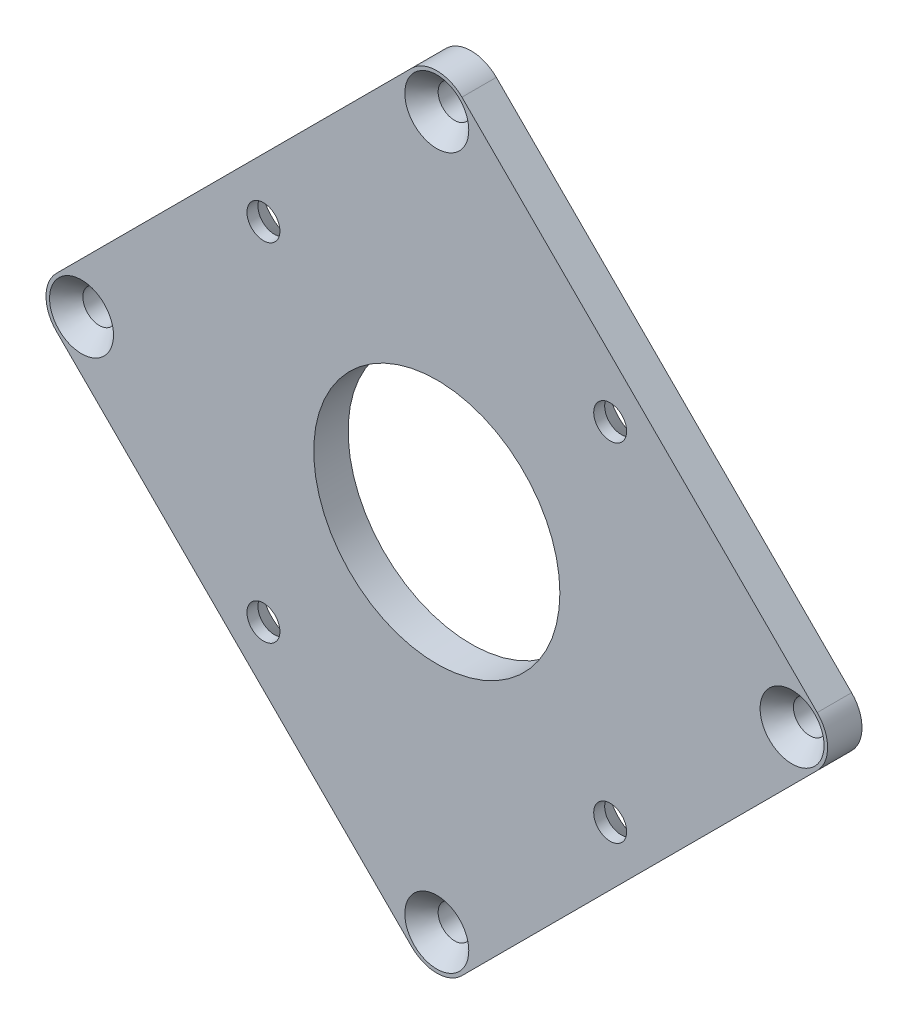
ISO-10303-21;
HEADER;
FILE_DESCRIPTION(('STEP AP214'),'2;1');
FILE_NAME('part.step','',(''),(''),'','','');
FILE_SCHEMA(('AUTOMOTIVE_DESIGN { 1 0 10303 214 1 1 1 1 }'));
ENDSEC;
DATA;
#1=APPLICATION_CONTEXT('core data for automotive mechanical design processes');
#2=APPLICATION_PROTOCOL_DEFINITION('international standard','automotive_design',2000,#1);
#3=PRODUCT_CONTEXT('',#1,'mechanical');
#4=PRODUCT('Part','Part','',(#3));
#5=PRODUCT_RELATED_PRODUCT_CATEGORY('part','',(#4));
#6=PRODUCT_DEFINITION_FORMATION('','',#4);
#7=PRODUCT_DEFINITION_CONTEXT('part definition',#1,'design');
#8=PRODUCT_DEFINITION('design','',#6,#7);
#9=PRODUCT_DEFINITION_SHAPE('','',#8);
#10=(LENGTH_UNIT() NAMED_UNIT(*) SI_UNIT(.MILLI.,.METRE.));
#11=(NAMED_UNIT(*) PLANE_ANGLE_UNIT() SI_UNIT($,.RADIAN.));
#12=(NAMED_UNIT(*) SI_UNIT($,.STERADIAN.) SOLID_ANGLE_UNIT());
#13=UNCERTAINTY_MEASURE_WITH_UNIT(LENGTH_MEASURE(1.E-05),#10,'distance_accuracy_value','');
#14=(GEOMETRIC_REPRESENTATION_CONTEXT(3) GLOBAL_UNCERTAINTY_ASSIGNED_CONTEXT((#13)) GLOBAL_UNIT_ASSIGNED_CONTEXT((#10,
#11,#12)) REPRESENTATION_CONTEXT('',''));
#15=CARTESIAN_POINT('',(0.,0.,0.));
#16=DIRECTION('',(0.,0.,1.));
#17=DIRECTION('',(1.,0.,0.));
#18=AXIS2_PLACEMENT_3D('',#15,#16,#17);
#19=CARTESIAN_POINT('',(-31.75,0.,3.0734));
#20=DIRECTION('',(0.,0.,1.));
#21=DIRECTION('',(1.,0.,0.));
#22=AXIS2_PLACEMENT_3D('',#19,#20,#21);
#23=PLANE('',#22);
#24=CARTESIAN_POINT('',(0.,-31.75,3.0734));
#25=DIRECTION('',(0.,0.,1.));
#26=DIRECTION('',(1.,0.,0.));
#27=AXIS2_PLACEMENT_3D('',#24,#25,#26);
#28=CIRCLE('',#27,2.857501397);
#29=CARTESIAN_POINT('',(2.857501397,-31.75,3.0734));
#30=VERTEX_POINT('',#29);
#31=EDGE_CURVE('E307',#30,#30,#28,.T.);
#32=ORIENTED_EDGE('',*,*,#31,.F.);
#33=EDGE_LOOP('',(#32));
#34=FACE_BOUND('',#33,.T.);
#35=CARTESIAN_POINT('',(-31.75,0.,3.0734));
#36=DIRECTION('',(0.,0.,1.));
#37=DIRECTION('',(1.,0.,0.));
#38=AXIS2_PLACEMENT_3D('',#35,#36,#37);
#39=CIRCLE('',#38,2.857501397);
#40=CARTESIAN_POINT('',(-28.892498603,0.,3.0734));
#41=VERTEX_POINT('',#40);
#42=EDGE_CURVE('E295',#41,#41,#39,.T.);
#43=ORIENTED_EDGE('',*,*,#42,.F.);
#44=EDGE_LOOP('',(#43));
#45=FACE_BOUND('',#44,.T.);
#46=CARTESIAN_POINT('',(0.,31.75,3.0734));
#47=DIRECTION('',(0.,0.,1.));
#48=DIRECTION('',(1.,0.,0.));
#49=AXIS2_PLACEMENT_3D('',#46,#47,#48);
#50=CIRCLE('',#49,2.857501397);
#51=CARTESIAN_POINT('',(2.857501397,31.75,3.0734));
#52=VERTEX_POINT('',#51);
#53=EDGE_CURVE('E283',#52,#52,#50,.T.);
#54=ORIENTED_EDGE('',*,*,#53,.F.);
#55=EDGE_LOOP('',(#54));
#56=FACE_BOUND('',#55,.T.);
#57=CARTESIAN_POINT('',(31.75,0.,3.0734));
#58=DIRECTION('',(0.,0.,1.));
#59=DIRECTION('',(1.,0.,0.));
#60=AXIS2_PLACEMENT_3D('',#57,#58,#59);
#61=CIRCLE('',#60,2.857501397);
#62=CARTESIAN_POINT('',(34.607501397,0.,3.0734));
#63=VERTEX_POINT('',#62);
#64=EDGE_CURVE('E271',#63,#63,#61,.T.);
#65=ORIENTED_EDGE('',*,*,#64,.F.);
#66=EDGE_LOOP('',(#65));
#67=FACE_BOUND('',#66,.T.);
#68=CARTESIAN_POINT('',(-15.494,-15.494,3.0734));
#69=DIRECTION('',(0.,0.,-1.));
#70=DIRECTION('',(-1.,0.,0.));
#71=AXIS2_PLACEMENT_3D('',#68,#69,#70);
#72=CIRCLE('',#71,1.4732);
#73=CARTESIAN_POINT('',(-16.9672,-15.494,3.0734));
#74=VERTEX_POINT('',#73);
#75=EDGE_CURVE('E251',#74,#74,#72,.T.);
#76=ORIENTED_EDGE('',*,*,#75,.T.);
#77=EDGE_LOOP('',(#76));
#78=FACE_BOUND('',#77,.T.);
#79=CARTESIAN_POINT('',(15.494,-15.494,3.0734));
#80=DIRECTION('',(0.,0.,-1.));
#81=DIRECTION('',(-1.,0.,0.));
#82=AXIS2_PLACEMENT_3D('',#79,#80,#81);
#83=CIRCLE('',#82,1.4732);
#84=CARTESIAN_POINT('',(14.0208,-15.494,3.0734));
#85=VERTEX_POINT('',#84);
#86=EDGE_CURVE('E239',#85,#85,#83,.T.);
#87=ORIENTED_EDGE('',*,*,#86,.T.);
#88=EDGE_LOOP('',(#87));
#89=FACE_BOUND('',#88,.T.);
#90=CARTESIAN_POINT('',(15.494,15.494,3.0734));
#91=DIRECTION('',(0.,0.,-1.));
#92=DIRECTION('',(-1.,0.,0.));
#93=AXIS2_PLACEMENT_3D('',#90,#91,#92);
#94=CIRCLE('',#93,1.4732);
#95=CARTESIAN_POINT('',(14.0208,15.494,3.0734));
#96=VERTEX_POINT('',#95);
#97=EDGE_CURVE('E227',#96,#96,#94,.T.);
#98=ORIENTED_EDGE('',*,*,#97,.T.);
#99=EDGE_LOOP('',(#98));
#100=FACE_BOUND('',#99,.T.);
#101=CARTESIAN_POINT('',(-15.494,15.494,3.0734));
#102=DIRECTION('',(0.,0.,-1.));
#103=DIRECTION('',(-1.,0.,0.));
#104=AXIS2_PLACEMENT_3D('',#101,#102,#103);
#105=CIRCLE('',#104,1.4732);
#106=CARTESIAN_POINT('',(-16.9672,15.494,3.0734));
#107=VERTEX_POINT('',#106);
#108=EDGE_CURVE('E212',#107,#107,#105,.T.);
#109=ORIENTED_EDGE('',*,*,#108,.T.);
#110=EDGE_LOOP('',(#109));
#111=FACE_BOUND('',#110,.T.);
#112=CARTESIAN_POINT('',(-31.75,0.,3.0734));
#113=DIRECTION('',(0.,0.,1.));
#114=DIRECTION('',(1.,0.,0.));
#115=AXIS2_PLACEMENT_3D('',#112,#113,#114);
#116=CIRCLE('',#115,3.175);
#117=CARTESIAN_POINT('',(-33.9950640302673,2.24506403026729,3.0734));
#118=VERTEX_POINT('',#117);
#119=CARTESIAN_POINT('',(-33.9950640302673,-2.24506403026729,3.0734));
#120=VERTEX_POINT('',#119);
#121=EDGE_CURVE('E163',#118,#120,#116,.T.);
#122=ORIENTED_EDGE('',*,*,#121,.T.);
#123=DIRECTION('',(0.707106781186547,-0.707106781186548,0.));
#124=VECTOR('',#123,1.);
#125=CARTESIAN_POINT('',(-33.9950640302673,-2.24506403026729,3.0734));
#126=LINE('',#125,#124);
#127=CARTESIAN_POINT('',(-2.24506403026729,-33.9950640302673,3.0734));
#128=VERTEX_POINT('',#127);
#129=EDGE_CURVE('E99',#120,#128,#126,.T.);
#130=ORIENTED_EDGE('',*,*,#129,.T.);
#131=CARTESIAN_POINT('',(0.,-31.75,3.0734));
#132=DIRECTION('',(0.,0.,1.));
#133=DIRECTION('',(1.,0.,0.));
#134=AXIS2_PLACEMENT_3D('',#131,#132,#133);
#135=CIRCLE('',#134,3.175);
#136=CARTESIAN_POINT('',(2.24506403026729,-33.9950640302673,3.0734));
#137=VERTEX_POINT('',#136);
#138=EDGE_CURVE('E184',#128,#137,#135,.T.);
#139=ORIENTED_EDGE('',*,*,#138,.T.);
#140=DIRECTION('',(0.707106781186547,0.707106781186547,0.));
#141=VECTOR('',#140,1.);
#142=CARTESIAN_POINT('',(2.24506403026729,-33.9950640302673,3.0734));
#143=LINE('',#142,#141);
#144=CARTESIAN_POINT('',(33.9950640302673,-2.24506403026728,3.0734));
#145=VERTEX_POINT('',#144);
#146=EDGE_CURVE('E198',#137,#145,#143,.T.);
#147=ORIENTED_EDGE('',*,*,#146,.T.);
#148=CARTESIAN_POINT('',(31.75,0.,3.0734));
#149=DIRECTION('',(0.,0.,1.));
#150=DIRECTION('',(1.,0.,0.));
#151=AXIS2_PLACEMENT_3D('',#148,#149,#150);
#152=CIRCLE('',#151,3.17499999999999);
#153=CARTESIAN_POINT('',(33.9950640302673,2.24506403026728,3.0734));
#154=VERTEX_POINT('',#153);
#155=EDGE_CURVE('E118',#145,#154,#152,.T.);
#156=ORIENTED_EDGE('',*,*,#155,.T.);
#157=DIRECTION('',(-0.707106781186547,0.707106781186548,0.));
#158=VECTOR('',#157,1.);
#159=CARTESIAN_POINT('',(33.9950640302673,2.24506403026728,3.0734));
#160=LINE('',#159,#158);
#161=CARTESIAN_POINT('',(2.24506403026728,33.9950640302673,3.0734));
#162=VERTEX_POINT('',#161);
#163=EDGE_CURVE('E112',#154,#162,#160,.T.);
#164=ORIENTED_EDGE('',*,*,#163,.T.);
#165=CARTESIAN_POINT('',(0.,31.75,3.0734));
#166=DIRECTION('',(0.,0.,1.));
#167=DIRECTION('',(-1.,0.,0.));
#168=AXIS2_PLACEMENT_3D('',#165,#166,#167);
#169=CIRCLE('',#168,3.17499999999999);
#170=CARTESIAN_POINT('',(-2.24506403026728,33.9950640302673,3.0734));
#171=VERTEX_POINT('',#170);
#172=EDGE_CURVE('E116',#162,#171,#169,.T.);
#173=ORIENTED_EDGE('',*,*,#172,.T.);
#174=DIRECTION('',(-0.707106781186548,-0.707106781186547,0.));
#175=VECTOR('',#174,1.);
#176=CARTESIAN_POINT('',(-2.24506403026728,33.9950640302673,3.0734));
#177=LINE('',#176,#175);
#178=EDGE_CURVE('E56',#171,#118,#177,.T.);
#179=ORIENTED_EDGE('',*,*,#178,.T.);
#180=EDGE_LOOP('',(#122,#130,#139,#147,#156,#164,#173,#179));
#181=FACE_BOUND('',#180,.T.);
#182=CARTESIAN_POINT('',(0.,0.,3.0734));
#183=DIRECTION('',(0.,0.,1.));
#184=DIRECTION('',(1.,0.,0.));
#185=AXIS2_PLACEMENT_3D('',#182,#183,#184);
#186=CIRCLE('',#185,10.9982);
#187=CARTESIAN_POINT('',(10.9982,0.,3.0734));
#188=VERTEX_POINT('',#187);
#189=EDGE_CURVE('E145',#188,#188,#186,.T.);
#190=ORIENTED_EDGE('',*,*,#189,.F.);
#191=EDGE_LOOP('',(#190));
#192=FACE_BOUND('',#191,.T.);
#193=ADVANCED_FACE('F38',(#34,#45,#56,#67,#78,#89,#100,#111,#181,#192),#23,.T.);
#194=CARTESIAN_POINT('',(-31.75,0.,0.));
#195=DIRECTION('',(0.,0.,1.));
#196=DIRECTION('',(1.,0.,0.));
#197=AXIS2_PLACEMENT_3D('',#194,#195,#196);
#198=PLANE('',#197);
#199=CARTESIAN_POINT('',(0.,-31.75,0.));
#200=DIRECTION('',(0.,0.,1.));
#201=DIRECTION('',(1.,0.,0.));
#202=AXIS2_PLACEMENT_3D('',#199,#200,#201);
#203=CIRCLE('',#202,1.4732);
#204=CARTESIAN_POINT('',(1.4732,-31.75,0.));
#205=VERTEX_POINT('',#204);
#206=EDGE_CURVE('E299',#205,#205,#203,.T.);
#207=ORIENTED_EDGE('',*,*,#206,.T.);
#208=EDGE_LOOP('',(#207));
#209=FACE_BOUND('',#208,.T.);
#210=CARTESIAN_POINT('',(-31.75,0.,0.));
#211=DIRECTION('',(0.,0.,1.));
#212=DIRECTION('',(1.,0.,0.));
#213=AXIS2_PLACEMENT_3D('',#210,#211,#212);
#214=CIRCLE('',#213,1.4732);
#215=CARTESIAN_POINT('',(-30.2768,0.,0.));
#216=VERTEX_POINT('',#215);
#217=EDGE_CURVE('E287',#216,#216,#214,.T.);
#218=ORIENTED_EDGE('',*,*,#217,.T.);
#219=EDGE_LOOP('',(#218));
#220=FACE_BOUND('',#219,.T.);
#221=CARTESIAN_POINT('',(0.,31.75,0.));
#222=DIRECTION('',(0.,0.,1.));
#223=DIRECTION('',(1.,0.,0.));
#224=AXIS2_PLACEMENT_3D('',#221,#222,#223);
#225=CIRCLE('',#224,1.4732);
#226=CARTESIAN_POINT('',(1.4732,31.75,0.));
#227=VERTEX_POINT('',#226);
#228=EDGE_CURVE('E275',#227,#227,#225,.T.);
#229=ORIENTED_EDGE('',*,*,#228,.T.);
#230=EDGE_LOOP('',(#229));
#231=FACE_BOUND('',#230,.T.);
#232=CARTESIAN_POINT('',(31.75,0.,0.));
#233=DIRECTION('',(0.,0.,1.));
#234=DIRECTION('',(1.,0.,0.));
#235=AXIS2_PLACEMENT_3D('',#232,#233,#234);
#236=CIRCLE('',#235,1.4732);
#237=CARTESIAN_POINT('',(33.2232,0.,0.));
#238=VERTEX_POINT('',#237);
#239=EDGE_CURVE('E263',#238,#238,#236,.T.);
#240=ORIENTED_EDGE('',*,*,#239,.T.);
#241=EDGE_LOOP('',(#240));
#242=FACE_BOUND('',#241,.T.);
#243=CARTESIAN_POINT('',(-15.494,-15.494,0.));
#244=DIRECTION('',(0.,0.,-1.));
#245=DIRECTION('',(-1.,0.,0.));
#246=AXIS2_PLACEMENT_3D('',#243,#244,#245);
#247=CIRCLE('',#246,3.2921448);
#248=CARTESIAN_POINT('',(-18.7861448,-15.494,0.));
#249=VERTEX_POINT('',#248);
#250=EDGE_CURVE('E259',#249,#249,#247,.T.);
#251=ORIENTED_EDGE('',*,*,#250,.F.);
#252=EDGE_LOOP('',(#251));
#253=FACE_BOUND('',#252,.T.);
#254=CARTESIAN_POINT('',(15.494,-15.494,0.));
#255=DIRECTION('',(0.,0.,-1.));
#256=DIRECTION('',(-1.,0.,0.));
#257=AXIS2_PLACEMENT_3D('',#254,#255,#256);
#258=CIRCLE('',#257,3.2921448);
#259=CARTESIAN_POINT('',(12.2018552,-15.494,0.));
#260=VERTEX_POINT('',#259);
#261=EDGE_CURVE('E247',#260,#260,#258,.T.);
#262=ORIENTED_EDGE('',*,*,#261,.F.);
#263=EDGE_LOOP('',(#262));
#264=FACE_BOUND('',#263,.T.);
#265=CARTESIAN_POINT('',(15.494,15.494,0.));
#266=DIRECTION('',(0.,0.,-1.));
#267=DIRECTION('',(-1.,0.,0.));
#268=AXIS2_PLACEMENT_3D('',#265,#266,#267);
#269=CIRCLE('',#268,3.2921448);
#270=CARTESIAN_POINT('',(12.2018552,15.494,0.));
#271=VERTEX_POINT('',#270);
#272=EDGE_CURVE('E235',#271,#271,#269,.T.);
#273=ORIENTED_EDGE('',*,*,#272,.F.);
#274=EDGE_LOOP('',(#273));
#275=FACE_BOUND('',#274,.T.);
#276=CARTESIAN_POINT('',(-15.494,15.494,0.));
#277=DIRECTION('',(0.,0.,-1.));
#278=DIRECTION('',(-1.,0.,0.));
#279=AXIS2_PLACEMENT_3D('',#276,#277,#278);
#280=CIRCLE('',#279,3.2921448);
#281=CARTESIAN_POINT('',(-18.7861448,15.494,0.));
#282=VERTEX_POINT('',#281);
#283=EDGE_CURVE('E223',#282,#282,#280,.T.);
#284=ORIENTED_EDGE('',*,*,#283,.F.);
#285=EDGE_LOOP('',(#284));
#286=FACE_BOUND('',#285,.T.);
#287=CARTESIAN_POINT('',(-31.75,0.,0.));
#288=DIRECTION('',(0.,0.,1.));
#289=DIRECTION('',(1.,0.,0.));
#290=AXIS2_PLACEMENT_3D('',#287,#288,#289);
#291=CIRCLE('',#290,3.175);
#292=CARTESIAN_POINT('',(-33.9950640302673,2.24506403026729,0.));
#293=VERTEX_POINT('',#292);
#294=CARTESIAN_POINT('',(-33.9950640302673,-2.24506403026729,0.));
#295=VERTEX_POINT('',#294);
#296=EDGE_CURVE('E140',#293,#295,#291,.T.);
#297=ORIENTED_EDGE('',*,*,#296,.F.);
#298=DIRECTION('',(-0.707106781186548,-0.707106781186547,0.));
#299=VECTOR('',#298,1.);
#300=CARTESIAN_POINT('',(-2.24506403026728,33.9950640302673,0.));
#301=LINE('',#300,#299);
#302=CARTESIAN_POINT('',(-2.24506403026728,33.9950640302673,0.));
#303=VERTEX_POINT('',#302);
#304=EDGE_CURVE('E91',#303,#293,#301,.T.);
#305=ORIENTED_EDGE('',*,*,#304,.F.);
#306=CARTESIAN_POINT('',(0.,31.75,0.));
#307=DIRECTION('',(0.,0.,1.));
#308=DIRECTION('',(-1.,0.,0.));
#309=AXIS2_PLACEMENT_3D('',#306,#307,#308);
#310=CIRCLE('',#309,3.17499999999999);
#311=CARTESIAN_POINT('',(2.24506403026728,33.9950640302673,0.));
#312=VERTEX_POINT('',#311);
#313=EDGE_CURVE('E85',#312,#303,#310,.T.);
#314=ORIENTED_EDGE('',*,*,#313,.F.);
#315=DIRECTION('',(-0.707106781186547,0.707106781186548,0.));
#316=VECTOR('',#315,1.);
#317=CARTESIAN_POINT('',(33.9950640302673,2.24506403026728,0.));
#318=LINE('',#317,#316);
#319=CARTESIAN_POINT('',(33.9950640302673,2.24506403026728,0.));
#320=VERTEX_POINT('',#319);
#321=EDGE_CURVE('E127',#320,#312,#318,.T.);
#322=ORIENTED_EDGE('',*,*,#321,.F.);
#323=CARTESIAN_POINT('',(31.75,0.,0.));
#324=DIRECTION('',(0.,0.,1.));
#325=DIRECTION('',(1.,0.,0.));
#326=AXIS2_PLACEMENT_3D('',#323,#324,#325);
#327=CIRCLE('',#326,3.17499999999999);
#328=CARTESIAN_POINT('',(33.9950640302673,-2.24506403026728,0.));
#329=VERTEX_POINT('',#328);
#330=EDGE_CURVE('E154',#329,#320,#327,.T.);
#331=ORIENTED_EDGE('',*,*,#330,.F.);
#332=DIRECTION('',(0.707106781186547,0.707106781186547,0.));
#333=VECTOR('',#332,1.);
#334=CARTESIAN_POINT('',(2.24506403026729,-33.9950640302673,0.));
#335=LINE('',#334,#333);
#336=CARTESIAN_POINT('',(2.24506403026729,-33.9950640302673,0.));
#337=VERTEX_POINT('',#336);
#338=EDGE_CURVE('E151',#337,#329,#335,.T.);
#339=ORIENTED_EDGE('',*,*,#338,.F.);
#340=CARTESIAN_POINT('',(0.,-31.75,0.));
#341=DIRECTION('',(0.,0.,1.));
#342=DIRECTION('',(1.,0.,0.));
#343=AXIS2_PLACEMENT_3D('',#340,#341,#342);
#344=CIRCLE('',#343,3.175);
#345=CARTESIAN_POINT('',(-2.24506403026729,-33.9950640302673,0.));
#346=VERTEX_POINT('',#345);
#347=EDGE_CURVE('E148',#346,#337,#344,.T.);
#348=ORIENTED_EDGE('',*,*,#347,.F.);
#349=DIRECTION('',(0.707106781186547,-0.707106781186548,0.));
#350=VECTOR('',#349,1.);
#351=CARTESIAN_POINT('',(-33.9950640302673,-2.24506403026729,0.));
#352=LINE('',#351,#350);
#353=EDGE_CURVE('E144',#295,#346,#352,.T.);
#354=ORIENTED_EDGE('',*,*,#353,.F.);
#355=EDGE_LOOP('',(#297,#305,#314,#322,#331,#339,#348,#354));
#356=FACE_BOUND('',#355,.T.);
#357=CARTESIAN_POINT('',(0.,0.,0.));
#358=DIRECTION('',(0.,0.,1.));
#359=DIRECTION('',(1.,0.,0.));
#360=AXIS2_PLACEMENT_3D('',#357,#358,#359);
#361=CIRCLE('',#360,10.9982);
#362=CARTESIAN_POINT('',(10.9982,0.,0.));
#363=VERTEX_POINT('',#362);
#364=EDGE_CURVE('E208',#363,#363,#361,.T.);
#365=ORIENTED_EDGE('',*,*,#364,.T.);
#366=EDGE_LOOP('',(#365));
#367=FACE_BOUND('',#366,.T.);
#368=ADVANCED_FACE('F188',(#209,#220,#231,#242,#253,#264,#275,#286,#356,#367),#198,.F.);
#369=CARTESIAN_POINT('',(-31.75,0.,3.0734));
#370=DIRECTION('',(0.,0.,-1.));
#371=DIRECTION('',(-1.,0.,0.));
#372=AXIS2_PLACEMENT_3D('',#369,#370,#371);
#373=CYLINDRICAL_SURFACE('',#372,3.175);
#374=ORIENTED_EDGE('',*,*,#296,.T.);
#375=DIRECTION('',(0.,0.,-1.));
#376=VECTOR('',#375,1.);
#377=CARTESIAN_POINT('',(-33.9950640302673,-2.24506403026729,3.0734));
#378=LINE('',#377,#376);
#379=EDGE_CURVE('E11',#120,#295,#378,.T.);
#380=ORIENTED_EDGE('',*,*,#379,.F.);
#381=ORIENTED_EDGE('',*,*,#121,.F.);
#382=DIRECTION('',(0.,0.,-1.));
#383=VECTOR('',#382,1.);
#384=CARTESIAN_POINT('',(-33.9950640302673,2.24506403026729,3.0734));
#385=LINE('',#384,#383);
#386=EDGE_CURVE('E136',#118,#293,#385,.T.);
#387=ORIENTED_EDGE('',*,*,#386,.T.);
#388=EDGE_LOOP('',(#374,#380,#381,#387));
#389=FACE_BOUND('',#388,.T.);
#390=ADVANCED_FACE('F40',(#389),#373,.T.);
#391=CARTESIAN_POINT('',(-33.9950640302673,-2.24506403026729,3.0734));
#392=DIRECTION('',(0.707106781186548,0.707106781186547,0.));
#393=DIRECTION('',(-0.707106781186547,0.707106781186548,0.));
#394=AXIS2_PLACEMENT_3D('',#391,#392,#393);
#395=PLANE('',#394);
#396=ORIENTED_EDGE('',*,*,#353,.T.);
#397=DIRECTION('',(0.,0.,-1.));
#398=VECTOR('',#397,1.);
#399=CARTESIAN_POINT('',(-2.24506403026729,-33.9950640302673,3.0734));
#400=LINE('',#399,#398);
#401=EDGE_CURVE('E48',#128,#346,#400,.T.);
#402=ORIENTED_EDGE('',*,*,#401,.F.);
#403=ORIENTED_EDGE('',*,*,#129,.F.);
#404=ORIENTED_EDGE('',*,*,#379,.T.);
#405=EDGE_LOOP('',(#396,#402,#403,#404));
#406=FACE_BOUND('',#405,.T.);
#407=ADVANCED_FACE('F351',(#406),#395,.F.);
#408=CARTESIAN_POINT('',(0.,-31.75,3.0734));
#409=DIRECTION('',(0.,0.,-1.));
#410=DIRECTION('',(-1.,0.,0.));
#411=AXIS2_PLACEMENT_3D('',#408,#409,#410);
#412=CYLINDRICAL_SURFACE('',#411,3.175);
#413=ORIENTED_EDGE('',*,*,#347,.T.);
#414=DIRECTION('',(0.,0.,-1.));
#415=VECTOR('',#414,1.);
#416=CARTESIAN_POINT('',(2.24506403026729,-33.9950640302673,3.0734));
#417=LINE('',#416,#415);
#418=EDGE_CURVE('E174',#137,#337,#417,.T.);
#419=ORIENTED_EDGE('',*,*,#418,.F.);
#420=ORIENTED_EDGE('',*,*,#138,.F.);
#421=ORIENTED_EDGE('',*,*,#401,.T.);
#422=EDGE_LOOP('',(#413,#419,#420,#421));
#423=FACE_BOUND('',#422,.T.);
#424=ADVANCED_FACE('F182',(#423),#412,.T.);
#425=CARTESIAN_POINT('',(2.24506403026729,-33.9950640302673,3.0734));
#426=DIRECTION('',(-0.707106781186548,0.707106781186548,0.));
#427=DIRECTION('',(-0.707106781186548,-0.707106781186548,0.));
#428=AXIS2_PLACEMENT_3D('',#425,#426,#427);
#429=PLANE('',#428);
#430=ORIENTED_EDGE('',*,*,#338,.T.);
#431=DIRECTION('',(0.,0.,-1.));
#432=VECTOR('',#431,1.);
#433=CARTESIAN_POINT('',(33.9950640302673,-2.24506403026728,3.0734));
#434=LINE('',#433,#432);
#435=EDGE_CURVE('E170',#145,#329,#434,.T.);
#436=ORIENTED_EDGE('',*,*,#435,.F.);
#437=ORIENTED_EDGE('',*,*,#146,.F.);
#438=ORIENTED_EDGE('',*,*,#418,.T.);
#439=EDGE_LOOP('',(#430,#436,#437,#438));
#440=FACE_BOUND('',#439,.T.);
#441=ADVANCED_FACE('F193',(#440),#429,.F.);
#442=CARTESIAN_POINT('',(31.75,0.,3.0734));
#443=DIRECTION('',(0.,0.,-1.));
#444=DIRECTION('',(-1.,0.,0.));
#445=AXIS2_PLACEMENT_3D('',#442,#443,#444);
#446=CYLINDRICAL_SURFACE('',#445,3.17499999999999);
#447=ORIENTED_EDGE('',*,*,#330,.T.);
#448=DIRECTION('',(0.,0.,-1.));
#449=VECTOR('',#448,1.);
#450=CARTESIAN_POINT('',(33.9950640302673,2.24506403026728,3.0734));
#451=LINE('',#450,#449);
#452=EDGE_CURVE('E129',#154,#320,#451,.T.);
#453=ORIENTED_EDGE('',*,*,#452,.F.);
#454=ORIENTED_EDGE('',*,*,#155,.F.);
#455=ORIENTED_EDGE('',*,*,#435,.T.);
#456=EDGE_LOOP('',(#447,#453,#454,#455));
#457=FACE_BOUND('',#456,.T.);
#458=ADVANCED_FACE('F196',(#457),#446,.T.);
#459=CARTESIAN_POINT('',(33.9950640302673,2.24506403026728,3.0734));
#460=DIRECTION('',(-0.707106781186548,-0.707106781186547,0.));
#461=DIRECTION('',(0.707106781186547,-0.707106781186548,0.));
#462=AXIS2_PLACEMENT_3D('',#459,#460,#461);
#463=PLANE('',#462);
#464=ORIENTED_EDGE('',*,*,#321,.T.);
#465=DIRECTION('',(0.,0.,-1.));
#466=VECTOR('',#465,1.);
#467=CARTESIAN_POINT('',(2.24506403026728,33.9950640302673,3.0734));
#468=LINE('',#467,#466);
#469=EDGE_CURVE('E124',#162,#312,#468,.T.);
#470=ORIENTED_EDGE('',*,*,#469,.F.);
#471=ORIENTED_EDGE('',*,*,#163,.F.);
#472=ORIENTED_EDGE('',*,*,#452,.T.);
#473=EDGE_LOOP('',(#464,#470,#471,#472));
#474=FACE_BOUND('',#473,.T.);
#475=ADVANCED_FACE('F125',(#474),#463,.F.);
#476=CARTESIAN_POINT('',(0.,31.75,3.0734));
#477=DIRECTION('',(0.,0.,-1.));
#478=DIRECTION('',(-1.,0.,0.));
#479=AXIS2_PLACEMENT_3D('',#476,#477,#478);
#480=CYLINDRICAL_SURFACE('',#479,3.17499999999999);
#481=ORIENTED_EDGE('',*,*,#313,.T.);
#482=DIRECTION('',(0.,0.,-1.));
#483=VECTOR('',#482,1.);
#484=CARTESIAN_POINT('',(-2.24506403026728,33.9950640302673,3.0734));
#485=LINE('',#484,#483);
#486=EDGE_CURVE('E130',#171,#303,#485,.T.);
#487=ORIENTED_EDGE('',*,*,#486,.F.);
#488=ORIENTED_EDGE('',*,*,#172,.F.);
#489=ORIENTED_EDGE('',*,*,#469,.T.);
#490=EDGE_LOOP('',(#481,#487,#488,#489));
#491=FACE_BOUND('',#490,.T.);
#492=ADVANCED_FACE('F132',(#491),#480,.T.);
#493=CARTESIAN_POINT('',(-2.24506403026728,33.9950640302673,3.0734));
#494=DIRECTION('',(0.707106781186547,-0.707106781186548,0.));
#495=DIRECTION('',(0.707106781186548,0.707106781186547,0.));
#496=AXIS2_PLACEMENT_3D('',#493,#494,#495);
#497=PLANE('',#496);
#498=ORIENTED_EDGE('',*,*,#304,.T.);
#499=ORIENTED_EDGE('',*,*,#386,.F.);
#500=ORIENTED_EDGE('',*,*,#178,.F.);
#501=ORIENTED_EDGE('',*,*,#486,.T.);
#502=EDGE_LOOP('',(#498,#499,#500,#501));
#503=FACE_BOUND('',#502,.T.);
#504=ADVANCED_FACE('F356',(#503),#497,.F.);
#505=CARTESIAN_POINT('',(0.,0.,3.0734));
#506=DIRECTION('',(0.,0.,-1.));
#507=DIRECTION('',(-1.,0.,0.));
#508=AXIS2_PLACEMENT_3D('',#505,#506,#507);
#509=CYLINDRICAL_SURFACE('',#508,10.9982);
#510=ORIENTED_EDGE('',*,*,#189,.T.);
#511=EDGE_LOOP('',(#510));
#512=FACE_BOUND('',#511,.T.);
#513=ORIENTED_EDGE('',*,*,#364,.F.);
#514=EDGE_LOOP('',(#513));
#515=FACE_BOUND('',#514,.T.);
#516=ADVANCED_FACE('F335',(#512,#515),#509,.F.);
#517=CARTESIAN_POINT('',(-15.494,15.494,0.));
#518=DIRECTION('',(0.,0.,-1.));
#519=DIRECTION('',(-1.,0.,0.));
#520=AXIS2_PLACEMENT_3D('',#517,#518,#519);
#521=CYLINDRICAL_SURFACE('',#520,1.4732);
#522=ORIENTED_EDGE('',*,*,#108,.F.);
#523=EDGE_LOOP('',(#522));
#524=FACE_BOUND('',#523,.T.);
#525=CARTESIAN_POINT('',(-15.494,15.494,2.09245663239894));
#526=DIRECTION('',(0.,0.,-1.));
#527=DIRECTION('',(-1.,0.,0.));
#528=AXIS2_PLACEMENT_3D('',#525,#526,#527);
#529=CIRCLE('',#528,1.4732);
#530=CARTESIAN_POINT('',(-16.9672,15.494,2.09245663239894));
#531=VERTEX_POINT('',#530);
#532=EDGE_CURVE('E219',#531,#531,#529,.T.);
#533=ORIENTED_EDGE('',*,*,#532,.T.);
#534=EDGE_LOOP('',(#533));
#535=FACE_BOUND('',#534,.T.);
#536=ADVANCED_FACE('F331',(#524,#535),#521,.F.);
#537=CARTESIAN_POINT('',(-15.494,15.494,0.));
#538=DIRECTION('',(0.,0.,-1.));
#539=DIRECTION('',(-1.,0.,0.));
#540=AXIS2_PLACEMENT_3D('',#537,#538,#539);
#541=CONICAL_SURFACE('',#540,3.2921448,0.715584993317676);
#542=ORIENTED_EDGE('',*,*,#532,.F.);
#543=EDGE_LOOP('',(#542));
#544=FACE_BOUND('',#543,.T.);
#545=ORIENTED_EDGE('',*,*,#283,.T.);
#546=EDGE_LOOP('',(#545));
#547=FACE_BOUND('',#546,.T.);
#548=ADVANCED_FACE('F334',(#544,#547),#541,.F.);
#549=CARTESIAN_POINT('',(15.494,15.494,0.));
#550=DIRECTION('',(0.,0.,-1.));
#551=DIRECTION('',(-1.,0.,0.));
#552=AXIS2_PLACEMENT_3D('',#549,#550,#551);
#553=CYLINDRICAL_SURFACE('',#552,1.4732);
#554=ORIENTED_EDGE('',*,*,#97,.F.);
#555=EDGE_LOOP('',(#554));
#556=FACE_BOUND('',#555,.T.);
#557=CARTESIAN_POINT('',(15.494,15.494,2.09245663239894));
#558=DIRECTION('',(0.,0.,-1.));
#559=DIRECTION('',(-1.,0.,0.));
#560=AXIS2_PLACEMENT_3D('',#557,#558,#559);
#561=CIRCLE('',#560,1.4732);
#562=CARTESIAN_POINT('',(14.0208,15.494,2.09245663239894));
#563=VERTEX_POINT('',#562);
#564=EDGE_CURVE('E231',#563,#563,#561,.T.);
#565=ORIENTED_EDGE('',*,*,#564,.T.);
#566=EDGE_LOOP('',(#565));
#567=FACE_BOUND('',#566,.T.);
#568=ADVANCED_FACE('F341',(#556,#567),#553,.F.);
#569=CARTESIAN_POINT('',(15.494,15.494,0.));
#570=DIRECTION('',(0.,0.,-1.));
#571=DIRECTION('',(-1.,0.,0.));
#572=AXIS2_PLACEMENT_3D('',#569,#570,#571);
#573=CONICAL_SURFACE('',#572,3.2921448,0.715584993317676);
#574=ORIENTED_EDGE('',*,*,#564,.F.);
#575=EDGE_LOOP('',(#574));
#576=FACE_BOUND('',#575,.T.);
#577=ORIENTED_EDGE('',*,*,#272,.T.);
#578=EDGE_LOOP('',(#577));
#579=FACE_BOUND('',#578,.T.);
#580=ADVANCED_FACE('F409',(#576,#579),#573,.F.);
#581=CARTESIAN_POINT('',(15.494,-15.494,0.));
#582=DIRECTION('',(0.,0.,-1.));
#583=DIRECTION('',(-1.,0.,0.));
#584=AXIS2_PLACEMENT_3D('',#581,#582,#583);
#585=CYLINDRICAL_SURFACE('',#584,1.4732);
#586=ORIENTED_EDGE('',*,*,#86,.F.);
#587=EDGE_LOOP('',(#586));
#588=FACE_BOUND('',#587,.T.);
#589=CARTESIAN_POINT('',(15.494,-15.494,2.09245663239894));
#590=DIRECTION('',(0.,0.,-1.));
#591=DIRECTION('',(-1.,0.,0.));
#592=AXIS2_PLACEMENT_3D('',#589,#590,#591);
#593=CIRCLE('',#592,1.4732);
#594=CARTESIAN_POINT('',(14.0208,-15.494,2.09245663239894));
#595=VERTEX_POINT('',#594);
#596=EDGE_CURVE('E243',#595,#595,#593,.T.);
#597=ORIENTED_EDGE('',*,*,#596,.T.);
#598=EDGE_LOOP('',(#597));
#599=FACE_BOUND('',#598,.T.);
#600=ADVANCED_FACE('F416',(#588,#599),#585,.F.);
#601=CARTESIAN_POINT('',(15.494,-15.494,0.));
#602=DIRECTION('',(0.,0.,-1.));
#603=DIRECTION('',(-1.,0.,0.));
#604=AXIS2_PLACEMENT_3D('',#601,#602,#603);
#605=CONICAL_SURFACE('',#604,3.2921448,0.715584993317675);
#606=ORIENTED_EDGE('',*,*,#596,.F.);
#607=EDGE_LOOP('',(#606));
#608=FACE_BOUND('',#607,.T.);
#609=ORIENTED_EDGE('',*,*,#261,.T.);
#610=EDGE_LOOP('',(#609));
#611=FACE_BOUND('',#610,.T.);
#612=ADVANCED_FACE('F423',(#608,#611),#605,.F.);
#613=CARTESIAN_POINT('',(-15.494,-15.494,0.));
#614=DIRECTION('',(0.,0.,-1.));
#615=DIRECTION('',(-1.,0.,0.));
#616=AXIS2_PLACEMENT_3D('',#613,#614,#615);
#617=CYLINDRICAL_SURFACE('',#616,1.4732);
#618=ORIENTED_EDGE('',*,*,#75,.F.);
#619=EDGE_LOOP('',(#618));
#620=FACE_BOUND('',#619,.T.);
#621=CARTESIAN_POINT('',(-15.494,-15.494,2.09245663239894));
#622=DIRECTION('',(0.,0.,-1.));
#623=DIRECTION('',(-1.,0.,0.));
#624=AXIS2_PLACEMENT_3D('',#621,#622,#623);
#625=CIRCLE('',#624,1.4732);
#626=CARTESIAN_POINT('',(-16.9672,-15.494,2.09245663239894));
#627=VERTEX_POINT('',#626);
#628=EDGE_CURVE('E255',#627,#627,#625,.T.);
#629=ORIENTED_EDGE('',*,*,#628,.T.);
#630=EDGE_LOOP('',(#629));
#631=FACE_BOUND('',#630,.T.);
#632=ADVANCED_FACE('F430',(#620,#631),#617,.F.);
#633=CARTESIAN_POINT('',(-15.494,-15.494,0.));
#634=DIRECTION('',(0.,0.,-1.));
#635=DIRECTION('',(-1.,0.,0.));
#636=AXIS2_PLACEMENT_3D('',#633,#634,#635);
#637=CONICAL_SURFACE('',#636,3.2921448,0.715584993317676);
#638=ORIENTED_EDGE('',*,*,#628,.F.);
#639=EDGE_LOOP('',(#638));
#640=FACE_BOUND('',#639,.T.);
#641=ORIENTED_EDGE('',*,*,#250,.T.);
#642=EDGE_LOOP('',(#641));
#643=FACE_BOUND('',#642,.T.);
#644=ADVANCED_FACE('F437',(#640,#643),#637,.F.);
#645=CARTESIAN_POINT('',(31.75,0.,3.0734));
#646=DIRECTION('',(0.,0.,1.));
#647=DIRECTION('',(1.,0.,0.));
#648=AXIS2_PLACEMENT_3D('',#645,#646,#647);
#649=CYLINDRICAL_SURFACE('',#648,1.4732);
#650=ORIENTED_EDGE('',*,*,#239,.F.);
#651=EDGE_LOOP('',(#650));
#652=FACE_BOUND('',#651,.T.);
#653=CARTESIAN_POINT('',(31.75,0.,1.48094340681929));
#654=DIRECTION('',(0.,0.,1.));
#655=DIRECTION('',(1.,0.,0.));
#656=AXIS2_PLACEMENT_3D('',#653,#654,#655);
#657=CIRCLE('',#656,1.4732);
#658=CARTESIAN_POINT('',(33.2232,0.,1.48094340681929));
#659=VERTEX_POINT('',#658);
#660=EDGE_CURVE('E267',#659,#659,#657,.T.);
#661=ORIENTED_EDGE('',*,*,#660,.T.);
#662=EDGE_LOOP('',(#661));
#663=FACE_BOUND('',#662,.T.);
#664=ADVANCED_FACE('F444',(#652,#663),#649,.F.);
#665=CARTESIAN_POINT('',(31.75,0.,3.0734));
#666=DIRECTION('',(0.,0.,1.));
#667=DIRECTION('',(1.,0.,0.));
#668=AXIS2_PLACEMENT_3D('',#665,#666,#667);
#669=CONICAL_SURFACE('',#668,2.857501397,0.715584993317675);
#670=ORIENTED_EDGE('',*,*,#660,.F.);
#671=EDGE_LOOP('',(#670));
#672=FACE_BOUND('',#671,.T.);
#673=ORIENTED_EDGE('',*,*,#64,.T.);
#674=EDGE_LOOP('',(#673));
#675=FACE_BOUND('',#674,.T.);
#676=ADVANCED_FACE('F451',(#672,#675),#669,.F.);
#677=CARTESIAN_POINT('',(0.,31.75,3.0734));
#678=DIRECTION('',(0.,0.,1.));
#679=DIRECTION('',(1.,0.,0.));
#680=AXIS2_PLACEMENT_3D('',#677,#678,#679);
#681=CYLINDRICAL_SURFACE('',#680,1.4732);
#682=ORIENTED_EDGE('',*,*,#228,.F.);
#683=EDGE_LOOP('',(#682));
#684=FACE_BOUND('',#683,.T.);
#685=CARTESIAN_POINT('',(0.,31.75,1.48094340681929));
#686=DIRECTION('',(0.,0.,1.));
#687=DIRECTION('',(1.,0.,0.));
#688=AXIS2_PLACEMENT_3D('',#685,#686,#687);
#689=CIRCLE('',#688,1.4732);
#690=CARTESIAN_POINT('',(1.4732,31.75,1.48094340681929));
#691=VERTEX_POINT('',#690);
#692=EDGE_CURVE('E279',#691,#691,#689,.T.);
#693=ORIENTED_EDGE('',*,*,#692,.T.);
#694=EDGE_LOOP('',(#693));
#695=FACE_BOUND('',#694,.T.);
#696=ADVANCED_FACE('F458',(#684,#695),#681,.F.);
#697=CARTESIAN_POINT('',(0.,31.75,3.0734));
#698=DIRECTION('',(0.,0.,1.));
#699=DIRECTION('',(1.,0.,0.));
#700=AXIS2_PLACEMENT_3D('',#697,#698,#699);
#701=CONICAL_SURFACE('',#700,2.857501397,0.715584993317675);
#702=ORIENTED_EDGE('',*,*,#692,.F.);
#703=EDGE_LOOP('',(#702));
#704=FACE_BOUND('',#703,.T.);
#705=ORIENTED_EDGE('',*,*,#53,.T.);
#706=EDGE_LOOP('',(#705));
#707=FACE_BOUND('',#706,.T.);
#708=ADVANCED_FACE('F465',(#704,#707),#701,.F.);
#709=CARTESIAN_POINT('',(-31.75,0.,3.0734));
#710=DIRECTION('',(0.,0.,1.));
#711=DIRECTION('',(1.,0.,0.));
#712=AXIS2_PLACEMENT_3D('',#709,#710,#711);
#713=CYLINDRICAL_SURFACE('',#712,1.4732);
#714=ORIENTED_EDGE('',*,*,#217,.F.);
#715=EDGE_LOOP('',(#714));
#716=FACE_BOUND('',#715,.T.);
#717=CARTESIAN_POINT('',(-31.75,0.,1.48094340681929));
#718=DIRECTION('',(0.,0.,1.));
#719=DIRECTION('',(1.,0.,0.));
#720=AXIS2_PLACEMENT_3D('',#717,#718,#719);
#721=CIRCLE('',#720,1.4732);
#722=CARTESIAN_POINT('',(-30.2768,0.,1.48094340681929));
#723=VERTEX_POINT('',#722);
#724=EDGE_CURVE('E291',#723,#723,#721,.T.);
#725=ORIENTED_EDGE('',*,*,#724,.T.);
#726=EDGE_LOOP('',(#725));
#727=FACE_BOUND('',#726,.T.);
#728=ADVANCED_FACE('F472',(#716,#727),#713,.F.);
#729=CARTESIAN_POINT('',(-31.75,0.,3.0734));
#730=DIRECTION('',(0.,0.,1.));
#731=DIRECTION('',(1.,0.,0.));
#732=AXIS2_PLACEMENT_3D('',#729,#730,#731);
#733=CONICAL_SURFACE('',#732,2.857501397,0.715584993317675);
#734=ORIENTED_EDGE('',*,*,#724,.F.);
#735=EDGE_LOOP('',(#734));
#736=FACE_BOUND('',#735,.T.);
#737=ORIENTED_EDGE('',*,*,#42,.T.);
#738=EDGE_LOOP('',(#737));
#739=FACE_BOUND('',#738,.T.);
#740=ADVANCED_FACE('F479',(#736,#739),#733,.F.);
#741=CARTESIAN_POINT('',(0.,-31.75,3.0734));
#742=DIRECTION('',(0.,0.,1.));
#743=DIRECTION('',(1.,0.,0.));
#744=AXIS2_PLACEMENT_3D('',#741,#742,#743);
#745=CYLINDRICAL_SURFACE('',#744,1.4732);
#746=ORIENTED_EDGE('',*,*,#206,.F.);
#747=EDGE_LOOP('',(#746));
#748=FACE_BOUND('',#747,.T.);
#749=CARTESIAN_POINT('',(0.,-31.75,1.48094340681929));
#750=DIRECTION('',(0.,0.,1.));
#751=DIRECTION('',(1.,0.,0.));
#752=AXIS2_PLACEMENT_3D('',#749,#750,#751);
#753=CIRCLE('',#752,1.4732);
#754=CARTESIAN_POINT('',(1.4732,-31.75,1.48094340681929));
#755=VERTEX_POINT('',#754);
#756=EDGE_CURVE('E303',#755,#755,#753,.T.);
#757=ORIENTED_EDGE('',*,*,#756,.T.);
#758=EDGE_LOOP('',(#757));
#759=FACE_BOUND('',#758,.T.);
#760=ADVANCED_FACE('F486',(#748,#759),#745,.F.);
#761=CARTESIAN_POINT('',(0.,-31.75,3.0734));
#762=DIRECTION('',(0.,0.,1.));
#763=DIRECTION('',(1.,0.,0.));
#764=AXIS2_PLACEMENT_3D('',#761,#762,#763);
#765=CONICAL_SURFACE('',#764,2.857501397,0.715584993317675);
#766=ORIENTED_EDGE('',*,*,#756,.F.);
#767=EDGE_LOOP('',(#766));
#768=FACE_BOUND('',#767,.T.);
#769=ORIENTED_EDGE('',*,*,#31,.T.);
#770=EDGE_LOOP('',(#769));
#771=FACE_BOUND('',#770,.T.);
#772=ADVANCED_FACE('F312',(#768,#771),#765,.F.);
#773=CLOSED_SHELL('',(#193,#368,#390,#407,#424,#441,#458,#475,#492,#504,#516,#536,#548,#568,
#580,#600,#612,#632,#644,#664,#676,#696,#708,#728,#740,#760,#772));
#774=MANIFOLD_SOLID_BREP('B2',#773);
#775=ADVANCED_BREP_SHAPE_REPRESENTATION('',(#18,#774),#14);
#776=SHAPE_DEFINITION_REPRESENTATION(#9,#775);
ENDSEC;
END-ISO-10303-21;
